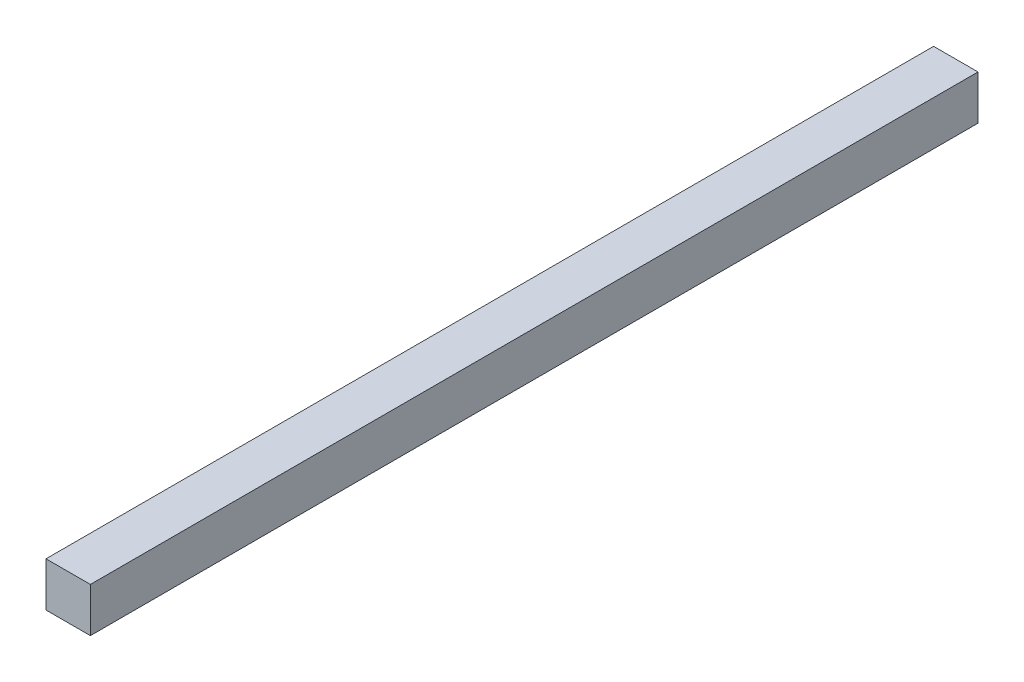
from build123d import *

# Parameters (mm, degrees)
CROQUIS1_W              = 12.7
CROQUIS1_H              = 12.7
SALIENTE_EXTRUIR1_DEPTH = 127


with BuildPart() as part:
    # Croquis1 → Saliente-Extruir1 (new, symmetric)
    with BuildSketch(Plane.XY):
        with Locations((0, -6.35)):
            Rectangle(CROQUIS1_W, CROQUIS1_H)
    extrude(amount=SALIENTE_EXTRUIR1_DEPTH, both=True)


solid = part.part
